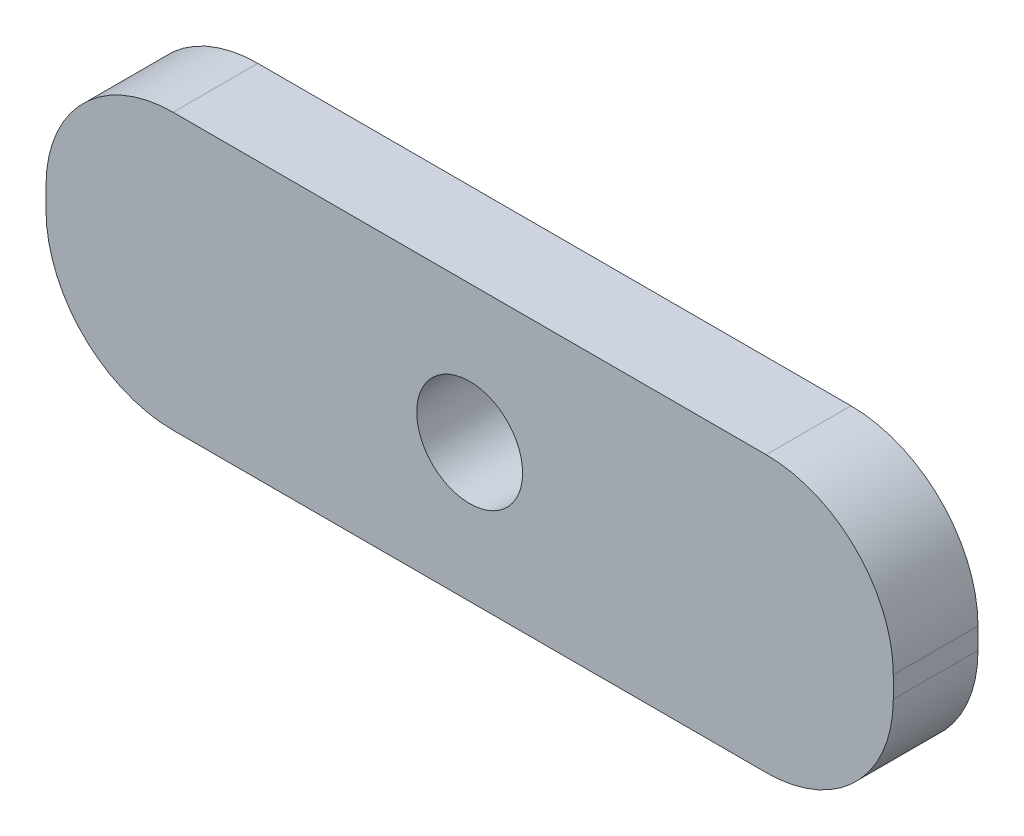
from build123d import *

# Parameters (mm, degrees)
ESQUISSE1_R        = 2.5
BOSS_EXTRU_2_DEPTH = 4


with BuildPart() as part:
    # Esquisse1 → Boss.-Extru.2 (new body)
    with BuildSketch(Plane.XY):
        with BuildLine():
            Line((-43.963493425, 0), (-15.963493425, 0))
            ThreePointArc((-15.963493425, 0), (-11.720852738, 1.757359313), (-9.963493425, 6))
            Line((-9.963493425, 6), (-9.963493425, 7))
            ThreePointArc((-9.963493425, 7), (-11.720852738, 11.242640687), (-15.963493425, 13))
            Line((-15.963493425, 13), (-43.963493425, 13))
            ThreePointArc((-43.963493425, 13), (-48.206134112, 11.242640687), (-49.963493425, 7))
            Line((-49.963493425, 7), (-49.963493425, 6))
            ThreePointArc((-49.963493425, 6), (-48.206134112, 1.757359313), (-43.963493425, 0))
        make_face()
        with Locations((-29.963493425, 6.5)):
            Circle(ESQUISSE1_R, mode=Mode.SUBTRACT)
    extrude(amount=BOSS_EXTRU_2_DEPTH)


solid = part.part
